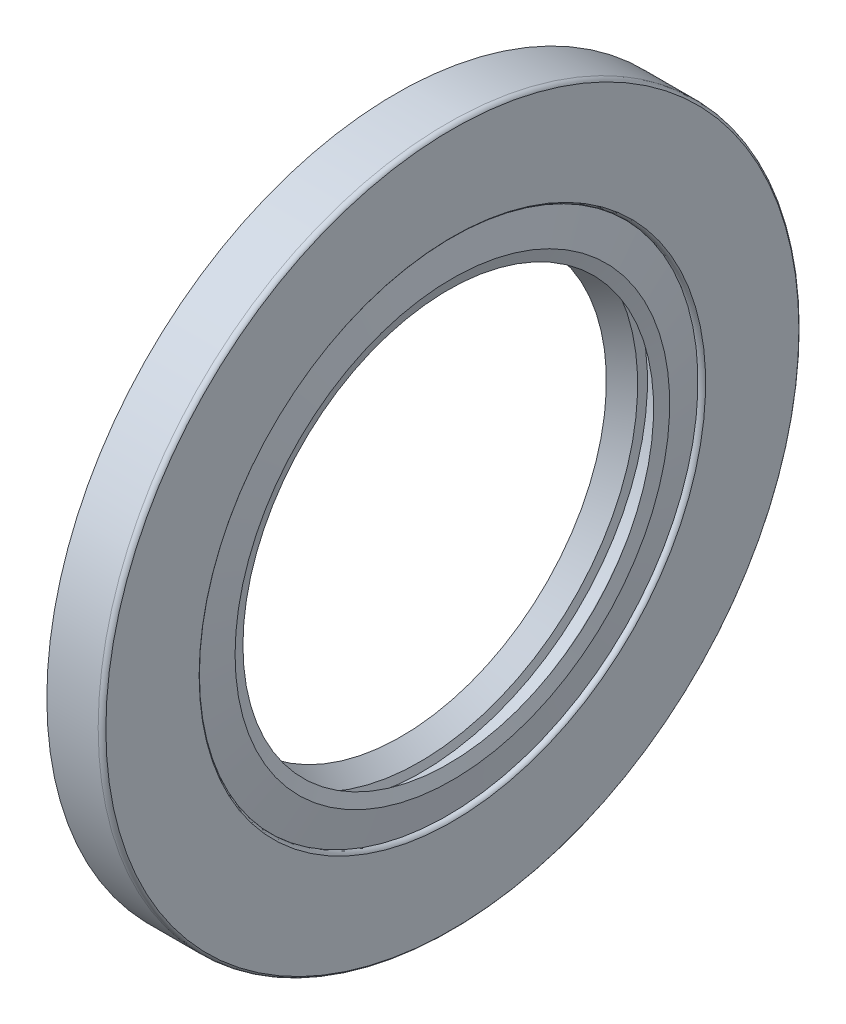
ISO-10303-21;
HEADER;
FILE_DESCRIPTION(('STEP AP214'),'2;1');
FILE_NAME('part.step','',(''),(''),'','','');
FILE_SCHEMA(('AUTOMOTIVE_DESIGN { 1 0 10303 214 1 1 1 1 }'));
ENDSEC;
DATA;
#1=APPLICATION_CONTEXT('core data for automotive mechanical design processes');
#2=APPLICATION_PROTOCOL_DEFINITION('international standard','automotive_design',2000,#1);
#3=PRODUCT_CONTEXT('',#1,'mechanical');
#4=PRODUCT('Part','Part','',(#3));
#5=PRODUCT_RELATED_PRODUCT_CATEGORY('part','',(#4));
#6=PRODUCT_DEFINITION_FORMATION('','',#4);
#7=PRODUCT_DEFINITION_CONTEXT('part definition',#1,'design');
#8=PRODUCT_DEFINITION('design','',#6,#7);
#9=PRODUCT_DEFINITION_SHAPE('','',#8);
#10=(LENGTH_UNIT() NAMED_UNIT(*) SI_UNIT(.MILLI.,.METRE.));
#11=(NAMED_UNIT(*) PLANE_ANGLE_UNIT() SI_UNIT($,.RADIAN.));
#12=(NAMED_UNIT(*) SI_UNIT($,.STERADIAN.) SOLID_ANGLE_UNIT());
#13=UNCERTAINTY_MEASURE_WITH_UNIT(LENGTH_MEASURE(1.E-05),#10,'distance_accuracy_value','');
#14=(GEOMETRIC_REPRESENTATION_CONTEXT(3) GLOBAL_UNCERTAINTY_ASSIGNED_CONTEXT((#13)) GLOBAL_UNIT_ASSIGNED_CONTEXT((#10,
#11,#12)) REPRESENTATION_CONTEXT('',''));
#15=CARTESIAN_POINT('',(0.,0.,0.));
#16=DIRECTION('',(0.,0.,1.));
#17=DIRECTION('',(1.,0.,0.));
#18=AXIS2_PLACEMENT_3D('',#15,#16,#17);
#19=CARTESIAN_POINT('',(0.,0.,0.));
#20=DIRECTION('',(-1.,0.,0.));
#21=DIRECTION('',(0.,0.,1.));
#22=AXIS2_PLACEMENT_3D('',#19,#20,#21);
#23=CYLINDRICAL_SURFACE('',#22,34.);
#24=CARTESIAN_POINT('',(5.5,0.,0.));
#25=DIRECTION('',(-1.,0.,0.));
#26=DIRECTION('',(0.,0.,1.));
#27=AXIS2_PLACEMENT_3D('',#24,#25,#26);
#28=CIRCLE('',#27,34.);
#29=CARTESIAN_POINT('',(5.5,0.,34.));
#30=VERTEX_POINT('',#29);
#31=EDGE_CURVE('E10',#30,#30,#28,.T.);
#32=ORIENTED_EDGE('',*,*,#31,.T.);
#33=EDGE_LOOP('',(#32));
#34=FACE_BOUND('',#33,.T.);
#35=CARTESIAN_POINT('',(0.5,0.,0.));
#36=DIRECTION('',(-1.,0.,0.));
#37=DIRECTION('',(0.,0.,1.));
#38=AXIS2_PLACEMENT_3D('',#35,#36,#37);
#39=CIRCLE('',#38,34.);
#40=CARTESIAN_POINT('',(0.5,0.,34.));
#41=VERTEX_POINT('',#40);
#42=EDGE_CURVE('E95',#41,#41,#39,.T.);
#43=ORIENTED_EDGE('',*,*,#42,.F.);
#44=EDGE_LOOP('',(#43));
#45=FACE_BOUND('',#44,.T.);
#46=ADVANCED_FACE('F28',(#34,#45),#23,.T.);
#47=CARTESIAN_POINT('',(5.56459503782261,0.,0.));
#48=DIRECTION('',(-1.,0.,0.));
#49=DIRECTION('',(0.,0.,1.));
#50=AXIS2_PLACEMENT_3D('',#47,#48,#49);
#51=TOROIDAL_SURFACE('',#50,33.5041900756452,0.5);
#52=ORIENTED_EDGE('',*,*,#31,.F.);
#53=EDGE_LOOP('',(#52));
#54=FACE_BOUND('',#53,.T.);
#55=CARTESIAN_POINT('',(6.,0.,0.));
#56=DIRECTION('',(-1.,0.,0.));
#57=DIRECTION('',(0.,0.,1.));
#58=AXIS2_PLACEMENT_3D('',#55,#56,#57);
#59=CIRCLE('',#58,33.75);
#60=CARTESIAN_POINT('',(6.,0.,33.75));
#61=VERTEX_POINT('',#60);
#62=EDGE_CURVE('E34',#61,#61,#59,.T.);
#63=ORIENTED_EDGE('',*,*,#62,.T.);
#64=EDGE_LOOP('',(#63));
#65=FACE_BOUND('',#64,.T.);
#66=ADVANCED_FACE('F103',(#54,#65),#51,.T.);
#67=CARTESIAN_POINT('',(6.,33.75,0.));
#68=DIRECTION('',(1.,0.,0.));
#69=DIRECTION('',(0.,0.,-1.));
#70=AXIS2_PLACEMENT_3D('',#67,#68,#69);
#71=PLANE('',#70);
#72=CARTESIAN_POINT('',(6.,0.,0.));
#73=DIRECTION('',(-1.,0.,0.));
#74=DIRECTION('',(0.,0.,1.));
#75=AXIS2_PLACEMENT_3D('',#72,#73,#74);
#76=CIRCLE('',#75,24.6666666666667);
#77=CARTESIAN_POINT('',(6.,0.,24.6666666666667));
#78=VERTEX_POINT('',#77);
#79=EDGE_CURVE('E38',#78,#78,#76,.T.);
#80=ORIENTED_EDGE('',*,*,#79,.T.);
#81=EDGE_LOOP('',(#80));
#82=FACE_BOUND('',#81,.T.);
#83=ORIENTED_EDGE('',*,*,#62,.F.);
#84=EDGE_LOOP('',(#83));
#85=FACE_BOUND('',#84,.T.);
#86=ADVANCED_FACE('F107',(#82,#85),#71,.T.);
#87=CARTESIAN_POINT('',(5.56459503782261,0.,0.));
#88=DIRECTION('',(-1.,0.,0.));
#89=DIRECTION('',(0.,0.,1.));
#90=AXIS2_PLACEMENT_3D('',#87,#88,#89);
#91=TOROIDAL_SURFACE('',#90,24.9124765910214,0.5);
#92=ORIENTED_EDGE('',*,*,#79,.F.);
#93=EDGE_LOOP('',(#92));
#94=FACE_BOUND('',#93,.T.);
#95=CARTESIAN_POINT('',(5.5,0.,0.));
#96=DIRECTION('',(-1.,0.,0.));
#97=DIRECTION('',(0.,0.,1.));
#98=AXIS2_PLACEMENT_3D('',#95,#96,#97);
#99=CIRCLE('',#98,24.4166666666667);
#100=CARTESIAN_POINT('',(5.5,0.,24.4166666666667));
#101=VERTEX_POINT('',#100);
#102=EDGE_CURVE('E42',#101,#101,#99,.T.);
#103=ORIENTED_EDGE('',*,*,#102,.T.);
#104=EDGE_LOOP('',(#103));
#105=FACE_BOUND('',#104,.T.);
#106=ADVANCED_FACE('F112',(#94,#105),#91,.T.);
#107=CARTESIAN_POINT('',(6.,0.,0.));
#108=DIRECTION('',(-1.,0.,0.));
#109=DIRECTION('',(0.,0.,1.));
#110=AXIS2_PLACEMENT_3D('',#107,#108,#109);
#111=CONICAL_SURFACE('',#110,21.1666666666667,1.41814699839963);
#112=ORIENTED_EDGE('',*,*,#102,.F.);
#113=EDGE_LOOP('',(#112));
#114=FACE_BOUND('',#113,.T.);
#115=CARTESIAN_POINT('',(6.,0.,0.));
#116=DIRECTION('',(-1.,0.,0.));
#117=DIRECTION('',(0.,0.,1.));
#118=AXIS2_PLACEMENT_3D('',#115,#116,#117);
#119=CIRCLE('',#118,21.1666666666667);
#120=CARTESIAN_POINT('',(6.,0.,21.1666666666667));
#121=VERTEX_POINT('',#120);
#122=EDGE_CURVE('E47',#121,#121,#119,.T.);
#123=ORIENTED_EDGE('',*,*,#122,.T.);
#124=EDGE_LOOP('',(#123));
#125=FACE_BOUND('',#124,.T.);
#126=ADVANCED_FACE('F118',(#114,#125),#111,.T.);
#127=CARTESIAN_POINT('',(5.6,0.,0.));
#128=DIRECTION('',(1.,0.,0.));
#129=DIRECTION('',(0.,0.,-1.));
#130=AXIS2_PLACEMENT_3D('',#127,#128,#129);
#131=CONICAL_SURFACE('',#130,20.,1.24049897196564);
#132=ORIENTED_EDGE('',*,*,#122,.F.);
#133=EDGE_LOOP('',(#132));
#134=FACE_BOUND('',#133,.T.);
#135=CARTESIAN_POINT('',(5.6,0.,0.));
#136=DIRECTION('',(-1.,0.,0.));
#137=DIRECTION('',(0.,0.,1.));
#138=AXIS2_PLACEMENT_3D('',#135,#136,#137);
#139=CIRCLE('',#138,20.);
#140=CARTESIAN_POINT('',(5.6,0.,20.));
#141=VERTEX_POINT('',#140);
#142=EDGE_CURVE('E50',#141,#141,#139,.T.);
#143=ORIENTED_EDGE('',*,*,#142,.T.);
#144=EDGE_LOOP('',(#143));
#145=FACE_BOUND('',#144,.T.);
#146=ADVANCED_FACE('F122',(#134,#145),#131,.F.);
#147=CARTESIAN_POINT('',(4.75,0.,0.));
#148=DIRECTION('',(-1.,0.,0.));
#149=DIRECTION('',(0.,0.,1.));
#150=AXIS2_PLACEMENT_3D('',#147,#148,#149);
#151=CONICAL_SURFACE('',#150,21.2444444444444,0.971546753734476);
#152=ORIENTED_EDGE('',*,*,#142,.F.);
#153=EDGE_LOOP('',(#152));
#154=FACE_BOUND('',#153,.T.);
#155=CARTESIAN_POINT('',(4.75,0.,0.));
#156=DIRECTION('',(-1.,0.,0.));
#157=DIRECTION('',(0.,0.,1.));
#158=AXIS2_PLACEMENT_3D('',#155,#156,#157);
#159=CIRCLE('',#158,21.2444444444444);
#160=CARTESIAN_POINT('',(4.75,0.,21.2444444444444));
#161=VERTEX_POINT('',#160);
#162=EDGE_CURVE('E53',#161,#161,#159,.T.);
#163=ORIENTED_EDGE('',*,*,#162,.T.);
#164=EDGE_LOOP('',(#163));
#165=FACE_BOUND('',#164,.T.);
#166=ADVANCED_FACE('F126',(#154,#165),#151,.F.);
#167=CARTESIAN_POINT('',(4.29428108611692,0.,0.));
#168=DIRECTION('',(-1.,0.,0.));
#169=DIRECTION('',(0.,0.,1.));
#170=AXIS2_PLACEMENT_3D('',#167,#168,#169);
#171=TOROIDAL_SURFACE('',#170,21.0387255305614,0.5);
#172=CARTESIAN_POINT('',(4.5,0.,0.));
#173=DIRECTION('',(-1.,0.,0.));
#174=DIRECTION('',(0.,0.,1.));
#175=AXIS2_PLACEMENT_3D('',#172,#173,#174);
#176=CIRCLE('',#175,21.4944444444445);
#177=CARTESIAN_POINT('',(4.5,0.,21.4944444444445));
#178=VERTEX_POINT('',#177);
#179=EDGE_CURVE('E56',#178,#178,#176,.T.);
#180=ORIENTED_EDGE('',*,*,#179,.T.);
#181=EDGE_LOOP('',(#180));
#182=FACE_BOUND('',#181,.T.);
#183=ORIENTED_EDGE('',*,*,#162,.F.);
#184=EDGE_LOOP('',(#183));
#185=FACE_BOUND('',#184,.T.);
#186=ADVANCED_FACE('F130',(#182,#185),#171,.F.);
#187=CARTESIAN_POINT('',(3.,0.,0.));
#188=DIRECTION('',(-1.,0.,0.));
#189=DIRECTION('',(0.,0.,1.));
#190=AXIS2_PLACEMENT_3D('',#187,#188,#189);
#191=CONICAL_SURFACE('',#190,22.,0.325080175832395);
#192=ORIENTED_EDGE('',*,*,#179,.F.);
#193=EDGE_LOOP('',(#192));
#194=FACE_BOUND('',#193,.T.);
#195=CARTESIAN_POINT('',(3.,0.,0.));
#196=DIRECTION('',(-1.,0.,0.));
#197=DIRECTION('',(0.,0.,1.));
#198=AXIS2_PLACEMENT_3D('',#195,#196,#197);
#199=CIRCLE('',#198,22.);
#200=CARTESIAN_POINT('',(3.,0.,22.));
#201=VERTEX_POINT('',#200);
#202=EDGE_CURVE('E59',#201,#201,#199,.T.);
#203=ORIENTED_EDGE('',*,*,#202,.T.);
#204=EDGE_LOOP('',(#203));
#205=FACE_BOUND('',#204,.T.);
#206=ADVANCED_FACE('F134',(#194,#205),#191,.F.);
#207=CARTESIAN_POINT('',(3.,0.,0.));
#208=DIRECTION('',(1.,0.,0.));
#209=DIRECTION('',(0.,0.,-1.));
#210=AXIS2_PLACEMENT_3D('',#207,#208,#209);
#211=CONICAL_SURFACE('',#210,22.,1.3120254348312);
#212=CARTESIAN_POINT('',(2.8,0.,0.));
#213=DIRECTION('',(-1.,0.,0.));
#214=DIRECTION('',(0.,0.,1.));
#215=AXIS2_PLACEMENT_3D('',#212,#213,#214);
#216=CIRCLE('',#215,21.2444444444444);
#217=CARTESIAN_POINT('',(2.8,0.,21.2444444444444));
#218=VERTEX_POINT('',#217);
#219=EDGE_CURVE('E62',#218,#218,#216,.T.);
#220=ORIENTED_EDGE('',*,*,#219,.T.);
#221=EDGE_LOOP('',(#220));
#222=FACE_BOUND('',#221,.T.);
#223=ORIENTED_EDGE('',*,*,#202,.F.);
#224=EDGE_LOOP('',(#223));
#225=FACE_BOUND('',#224,.T.);
#226=ADVANCED_FACE('F138',(#222,#225),#211,.F.);
#227=CARTESIAN_POINT('',(2.8,0.,0.));
#228=DIRECTION('',(1.,0.,0.));
#229=DIRECTION('',(0.,0.,-1.));
#230=AXIS2_PLACEMENT_3D('',#227,#228,#229);
#231=CONICAL_SURFACE('',#230,21.2444444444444,0.604902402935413);
#232=CARTESIAN_POINT('',(1.,0.,0.));
#233=DIRECTION('',(-1.,0.,0.));
#234=DIRECTION('',(0.,0.,1.));
#235=AXIS2_PLACEMENT_3D('',#232,#233,#234);
#236=CIRCLE('',#235,20.);
#237=CARTESIAN_POINT('',(1.,0.,20.));
#238=VERTEX_POINT('',#237);
#239=EDGE_CURVE('E65',#238,#238,#236,.T.);
#240=ORIENTED_EDGE('',*,*,#239,.T.);
#241=EDGE_LOOP('',(#240));
#242=FACE_BOUND('',#241,.T.);
#243=ORIENTED_EDGE('',*,*,#219,.F.);
#244=EDGE_LOOP('',(#243));
#245=FACE_BOUND('',#244,.T.);
#246=ADVANCED_FACE('F142',(#242,#245),#231,.F.);
#247=CARTESIAN_POINT('',(1.,0.,0.));
#248=DIRECTION('',(-1.,0.,0.));
#249=DIRECTION('',(0.,0.,1.));
#250=AXIS2_PLACEMENT_3D('',#247,#248,#249);
#251=CONICAL_SURFACE('',#250,20.,1.27933953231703);
#252=CARTESIAN_POINT('',(0.4,0.,0.));
#253=DIRECTION('',(-1.,0.,0.));
#254=DIRECTION('',(0.,0.,1.));
#255=AXIS2_PLACEMENT_3D('',#252,#253,#254);
#256=CIRCLE('',#255,22.);
#257=CARTESIAN_POINT('',(0.4,0.,22.));
#258=VERTEX_POINT('',#257);
#259=EDGE_CURVE('E68',#258,#258,#256,.T.);
#260=ORIENTED_EDGE('',*,*,#259,.T.);
#261=EDGE_LOOP('',(#260));
#262=FACE_BOUND('',#261,.T.);
#263=ORIENTED_EDGE('',*,*,#239,.F.);
#264=EDGE_LOOP('',(#263));
#265=FACE_BOUND('',#264,.T.);
#266=ADVANCED_FACE('F146',(#262,#265),#251,.F.);
#267=CARTESIAN_POINT('',(0.4,22.,0.));
#268=DIRECTION('',(-1.,0.,0.));
#269=DIRECTION('',(0.,0.,1.));
#270=AXIS2_PLACEMENT_3D('',#267,#268,#269);
#271=PLANE('',#270);
#272=CARTESIAN_POINT('',(0.4,0.,0.));
#273=DIRECTION('',(-1.,0.,0.));
#274=DIRECTION('',(0.,0.,1.));
#275=AXIS2_PLACEMENT_3D('',#272,#273,#274);
#276=CIRCLE('',#275,24.5310795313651);
#277=CARTESIAN_POINT('',(0.4,0.,24.5310795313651));
#278=VERTEX_POINT('',#277);
#279=EDGE_CURVE('E71',#278,#278,#276,.T.);
#280=ORIENTED_EDGE('',*,*,#279,.T.);
#281=EDGE_LOOP('',(#280));
#282=FACE_BOUND('',#281,.T.);
#283=ORIENTED_EDGE('',*,*,#259,.F.);
#284=EDGE_LOOP('',(#283));
#285=FACE_BOUND('',#284,.T.);
#286=ADVANCED_FACE('F150',(#282,#285),#271,.T.);
#287=CARTESIAN_POINT('',(0.,0.,0.));
#288=DIRECTION('',(-1.,0.,0.));
#289=DIRECTION('',(0.,0.,1.));
#290=AXIS2_PLACEMENT_3D('',#287,#288,#289);
#291=CYLINDRICAL_SURFACE('',#290,24.5310795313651);
#292=CARTESIAN_POINT('',(1.00062539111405,0.,0.));
#293=DIRECTION('',(-1.,0.,0.));
#294=DIRECTION('',(0.,0.,1.));
#295=AXIS2_PLACEMENT_3D('',#292,#293,#294);
#296=CIRCLE('',#295,24.5310795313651);
#297=CARTESIAN_POINT('',(1.00062539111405,0.,24.5310795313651));
#298=VERTEX_POINT('',#297);
#299=EDGE_CURVE('E74',#298,#298,#296,.T.);
#300=ORIENTED_EDGE('',*,*,#299,.T.);
#301=EDGE_LOOP('',(#300));
#302=FACE_BOUND('',#301,.T.);
#303=ORIENTED_EDGE('',*,*,#279,.F.);
#304=EDGE_LOOP('',(#303));
#305=FACE_BOUND('',#304,.T.);
#306=ADVANCED_FACE('F154',(#302,#305),#291,.T.);
#307=CARTESIAN_POINT('',(1.5,0.,0.));
#308=DIRECTION('',(-1.,0.,0.));
#309=DIRECTION('',(0.,0.,1.));
#310=AXIS2_PLACEMENT_3D('',#307,#308,#309);
#311=TOROIDAL_SURFACE('',#310,23.5,1.14564392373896);
#312=ORIENTED_EDGE('',*,*,#299,.F.);
#313=EDGE_LOOP('',(#312));
#314=FACE_BOUND('',#313,.T.);
#315=CARTESIAN_POINT('',(2.50147297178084,0.,0.));
#316=DIRECTION('',(-1.,0.,0.));
#317=DIRECTION('',(0.,0.,1.));
#318=AXIS2_PLACEMENT_3D('',#315,#316,#317);
#319=CIRCLE('',#318,24.0563738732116);
#320=CARTESIAN_POINT('',(2.50147297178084,0.,24.0563738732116));
#321=VERTEX_POINT('',#320);
#322=EDGE_CURVE('E77',#321,#321,#319,.T.);
#323=ORIENTED_EDGE('',*,*,#322,.T.);
#324=EDGE_LOOP('',(#323));
#325=FACE_BOUND('',#324,.T.);
#326=ADVANCED_FACE('F158',(#314,#325),#311,.T.);
#327=CARTESIAN_POINT('',(3.6,0.,0.));
#328=DIRECTION('',(1.,0.,0.));
#329=DIRECTION('',(0.,0.,-1.));
#330=AXIS2_PLACEMENT_3D('',#327,#328,#329);
#331=CONICAL_SURFACE('',#330,24.6666666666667,0.507098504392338);
#332=ORIENTED_EDGE('',*,*,#322,.F.);
#333=EDGE_LOOP('',(#332));
#334=FACE_BOUND('',#333,.T.);
#335=CARTESIAN_POINT('',(3.6,0.,0.));
#336=DIRECTION('',(-1.,0.,0.));
#337=DIRECTION('',(0.,0.,1.));
#338=AXIS2_PLACEMENT_3D('',#335,#336,#337);
#339=CIRCLE('',#338,24.6666666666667);
#340=CARTESIAN_POINT('',(3.6,0.,24.6666666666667));
#341=VERTEX_POINT('',#340);
#342=EDGE_CURVE('E80',#341,#341,#339,.T.);
#343=ORIENTED_EDGE('',*,*,#342,.T.);
#344=EDGE_LOOP('',(#343));
#345=FACE_BOUND('',#344,.T.);
#346=ADVANCED_FACE('F162',(#334,#345),#331,.T.);
#347=CARTESIAN_POINT('',(3.6,30.25,0.));
#348=DIRECTION('',(1.,0.,0.));
#349=DIRECTION('',(0.,0.,-1.));
#350=AXIS2_PLACEMENT_3D('',#347,#348,#349);
#351=PLANE('',#350);
#352=ORIENTED_EDGE('',*,*,#342,.F.);
#353=EDGE_LOOP('',(#352));
#354=FACE_BOUND('',#353,.T.);
#355=CARTESIAN_POINT('',(3.6,0.,0.));
#356=DIRECTION('',(-1.,0.,0.));
#357=DIRECTION('',(0.,0.,1.));
#358=AXIS2_PLACEMENT_3D('',#355,#356,#357);
#359=CIRCLE('',#358,30.25);
#360=CARTESIAN_POINT('',(3.6,0.,30.25));
#361=VERTEX_POINT('',#360);
#362=EDGE_CURVE('E83',#361,#361,#359,.T.);
#363=ORIENTED_EDGE('',*,*,#362,.T.);
#364=EDGE_LOOP('',(#363));
#365=FACE_BOUND('',#364,.T.);
#366=ADVANCED_FACE('F166',(#354,#365),#351,.F.);
#367=CARTESIAN_POINT('',(3.14428108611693,0.,0.));
#368=DIRECTION('',(-1.,0.,0.));
#369=DIRECTION('',(0.,0.,1.));
#370=AXIS2_PLACEMENT_3D('',#367,#368,#369);
#371=TOROIDAL_SURFACE('',#370,30.0442810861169,0.5);
#372=CARTESIAN_POINT('',(3.35,0.,0.));
#373=DIRECTION('',(-1.,0.,0.));
#374=DIRECTION('',(0.,0.,1.));
#375=AXIS2_PLACEMENT_3D('',#372,#373,#374);
#376=CIRCLE('',#375,30.5);
#377=CARTESIAN_POINT('',(3.35,0.,30.5));
#378=VERTEX_POINT('',#377);
#379=EDGE_CURVE('E86',#378,#378,#376,.T.);
#380=ORIENTED_EDGE('',*,*,#379,.T.);
#381=EDGE_LOOP('',(#380));
#382=FACE_BOUND('',#381,.T.);
#383=ORIENTED_EDGE('',*,*,#362,.F.);
#384=EDGE_LOOP('',(#383));
#385=FACE_BOUND('',#384,.T.);
#386=ADVANCED_FACE('F170',(#382,#385),#371,.F.);
#387=CARTESIAN_POINT('',(0.,0.,0.));
#388=DIRECTION('',(-1.,0.,0.));
#389=DIRECTION('',(0.,0.,1.));
#390=AXIS2_PLACEMENT_3D('',#387,#388,#389);
#391=CONICAL_SURFACE('',#390,31.2,0.205991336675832);
#392=ORIENTED_EDGE('',*,*,#379,.F.);
#393=EDGE_LOOP('',(#392));
#394=FACE_BOUND('',#393,.T.);
#395=CARTESIAN_POINT('',(0.,0.,0.));
#396=DIRECTION('',(-1.,0.,0.));
#397=DIRECTION('',(0.,0.,1.));
#398=AXIS2_PLACEMENT_3D('',#395,#396,#397);
#399=CIRCLE('',#398,31.2);
#400=CARTESIAN_POINT('',(0.,0.,31.2));
#401=VERTEX_POINT('',#400);
#402=EDGE_CURVE('E89',#401,#401,#399,.T.);
#403=ORIENTED_EDGE('',*,*,#402,.T.);
#404=EDGE_LOOP('',(#403));
#405=FACE_BOUND('',#404,.T.);
#406=ADVANCED_FACE('F174',(#394,#405),#391,.F.);
#407=CARTESIAN_POINT('',(0.,31.2,0.));
#408=DIRECTION('',(-1.,0.,0.));
#409=DIRECTION('',(0.,0.,1.));
#410=AXIS2_PLACEMENT_3D('',#407,#408,#409);
#411=PLANE('',#410);
#412=CARTESIAN_POINT('',(0.,0.,0.));
#413=DIRECTION('',(-1.,0.,0.));
#414=DIRECTION('',(0.,0.,1.));
#415=AXIS2_PLACEMENT_3D('',#412,#413,#414);
#416=CIRCLE('',#415,32.8333333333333);
#417=CARTESIAN_POINT('',(0.,0.,32.8333333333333));
#418=VERTEX_POINT('',#417);
#419=EDGE_CURVE('E92',#418,#418,#416,.T.);
#420=ORIENTED_EDGE('',*,*,#419,.T.);
#421=EDGE_LOOP('',(#420));
#422=FACE_BOUND('',#421,.T.);
#423=ORIENTED_EDGE('',*,*,#402,.F.);
#424=EDGE_LOOP('',(#423));
#425=FACE_BOUND('',#424,.T.);
#426=ADVANCED_FACE('F178',(#422,#425),#411,.T.);
#427=CARTESIAN_POINT('',(0.,0.,0.));
#428=DIRECTION('',(1.,0.,0.));
#429=DIRECTION('',(0.,0.,-1.));
#430=AXIS2_PLACEMENT_3D('',#427,#428,#429);
#431=CONICAL_SURFACE('',#430,32.8333333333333,1.16590454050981);
#432=ORIENTED_EDGE('',*,*,#42,.T.);
#433=EDGE_LOOP('',(#432));
#434=FACE_BOUND('',#433,.T.);
#435=ORIENTED_EDGE('',*,*,#419,.F.);
#436=EDGE_LOOP('',(#435));
#437=FACE_BOUND('',#436,.T.);
#438=ADVANCED_FACE('F99',(#434,#437),#431,.T.);
#439=CLOSED_SHELL('',(#46,#66,#86,#106,#126,#146,#166,#186,#206,#226,#246,#266,#286,#306,#326,
#346,#366,#386,#406,#426,#438));
#440=MANIFOLD_SOLID_BREP('B2',#439);
#441=ADVANCED_BREP_SHAPE_REPRESENTATION('',(#18,#440),#14);
#442=SHAPE_DEFINITION_REPRESENTATION(#9,#441);
ENDSEC;
END-ISO-10303-21;
